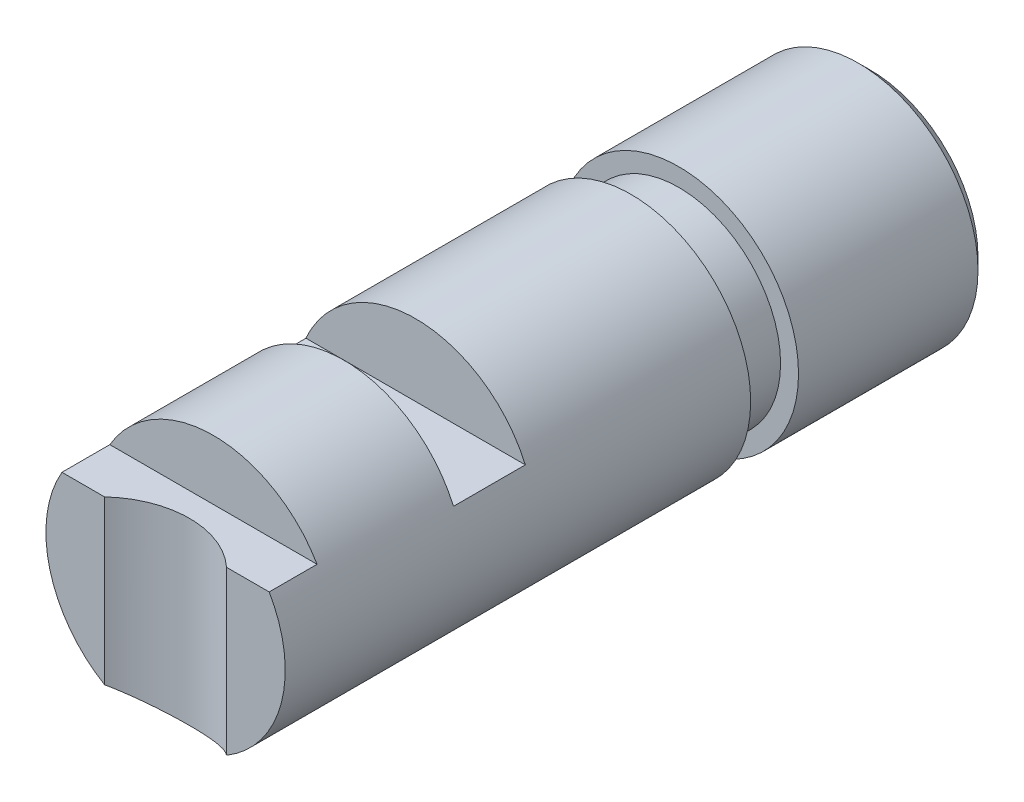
from build123d import *

# Parameters (mm, degrees)
ESQUISSE1_R             = 5
EXTRUSION1_DEPTH        = 29.45
ESQUISSE6_OUTSIDE_W     = 18.534
ESQUISSE6_OUTSIDE_H     = 18.534
ESQUISSE6_OUTSIDE_R     = 4.25
ENL_V_MAT_EXTRU_4_DEPTH = 2
CHANFREIN1_SIZE         = 0.5
ESQUISSE8_W             = 10.442515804
ESQUISSE8_H             = 3.535840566
ENL_V_MAT_EXTRU_5_DEPTH = 3
ESQUISSE9_W             = 10
ESQUISSE9_H             = 2
ENL_V_MAT_EXTRU_6_DEPTH = 2.5
ESQUISSE10_R            = 3.75
ENL_V_MAT_EXTRU_7_DEPTH = 31.798579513


with BuildPart() as part:
    # Esquisse1 → Extrusion1 (new body)
    with BuildSketch(Plane.XY):
        with Locations(Location((0, 0, 0), (0, 0, 180))):
            Circle(ESQUISSE1_R)
    extrude(amount=EXTRUSION1_DEPTH)

    # Esquisse6 outside → Enl_v. mat.-Extru.4 (cut)
    with BuildSketch(Plane.XY.offset(8)):
        Rectangle(ESQUISSE6_OUTSIDE_W, ESQUISSE6_OUTSIDE_H)
        Circle(ESQUISSE6_OUTSIDE_R, mode=Mode.SUBTRACT)
    extrude(amount=ENL_V_MAT_EXTRU_4_DEPTH, mode=Mode.SUBTRACT)

    # Chanfrein1
    chanfrein1_edges = [part.edges().sort_by_distance(p)[0] for p in [
        (5, 0, 0),
    ]]
    chamfer(chanfrein1_edges, length=CHANFREIN1_SIZE)

    # Esquisse8 → Enl_v. mat.-Extru.5 (cut)
    with BuildSketch(Plane(origin=(0, 0, 19), x_dir=(-1, 0, 0), z_dir=(0, 0, -1))):
        with Locations((-0.011786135, 3.767920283)):
            Rectangle(ESQUISSE8_W, ESQUISSE8_H)
    extrude(amount=-ENL_V_MAT_EXTRU_5_DEPTH, mode=Mode.SUBTRACT)

    # Esquisse9 → Enl_v. mat.-Extru.6 (cut)
    with BuildSketch(Plane(origin=(0, 5, 0), x_dir=(-1, 0, 0), z_dir=(0, 1, 0))):
        with Locations((0, 28.45)):
            Rectangle(ESQUISSE9_W, ESQUISSE9_H)
    extrude(amount=-ENL_V_MAT_EXTRU_6_DEPTH, mode=Mode.SUBTRACT)

    # Esquisse10 → Enl_v. mat.-Extru.7 (cut, through all)
    with BuildSketch(Plane(origin=(0, 2.5, 0), x_dir=(-1, 0, 0), z_dir=(0, 1, 0))):
        with Locations((0, 32.2)):
            Circle(ESQUISSE10_R)
    extrude(amount=-ENL_V_MAT_EXTRU_7_DEPTH, mode=Mode.SUBTRACT)


solid = part.part
